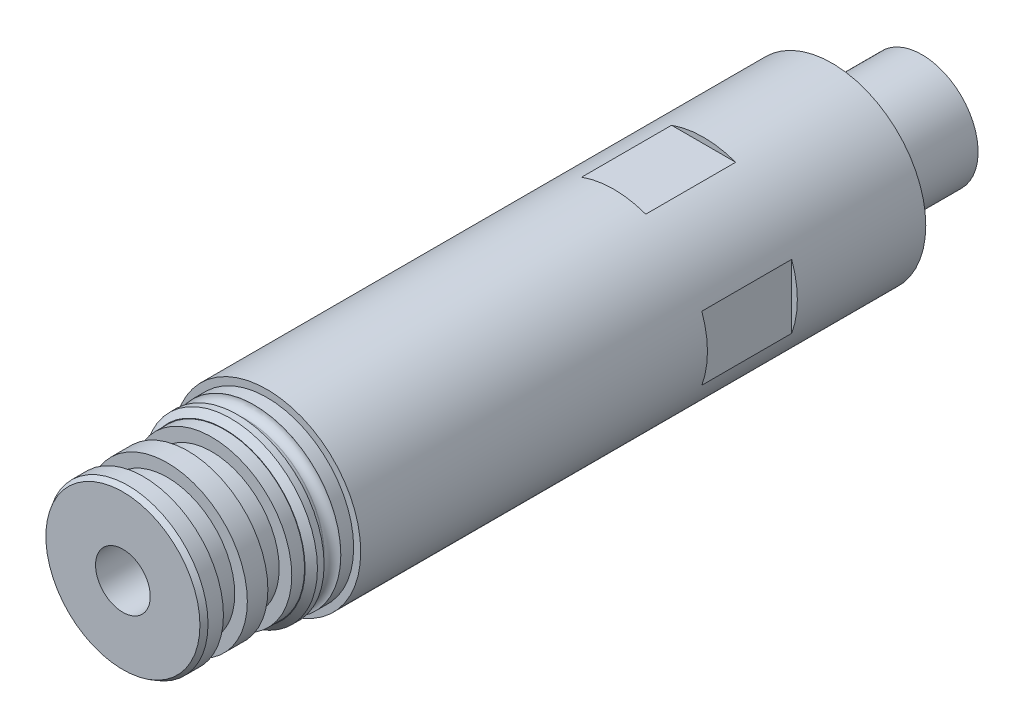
ISO-10303-21;
HEADER;
FILE_DESCRIPTION(('STEP AP214'),'2;1');
FILE_NAME('part.step','',(''),(''),'','','');
FILE_SCHEMA(('AUTOMOTIVE_DESIGN { 1 0 10303 214 1 1 1 1 }'));
ENDSEC;
DATA;
#1=APPLICATION_CONTEXT('core data for automotive mechanical design processes');
#2=APPLICATION_PROTOCOL_DEFINITION('international standard','automotive_design',2000,#1);
#3=PRODUCT_CONTEXT('',#1,'mechanical');
#4=PRODUCT('Part','Part','',(#3));
#5=PRODUCT_RELATED_PRODUCT_CATEGORY('part','',(#4));
#6=PRODUCT_DEFINITION_FORMATION('','',#4);
#7=PRODUCT_DEFINITION_CONTEXT('part definition',#1,'design');
#8=PRODUCT_DEFINITION('design','',#6,#7);
#9=PRODUCT_DEFINITION_SHAPE('','',#8);
#10=(LENGTH_UNIT() NAMED_UNIT(*) SI_UNIT(.MILLI.,.METRE.));
#11=(NAMED_UNIT(*) PLANE_ANGLE_UNIT() SI_UNIT($,.RADIAN.));
#12=(NAMED_UNIT(*) SI_UNIT($,.STERADIAN.) SOLID_ANGLE_UNIT());
#13=UNCERTAINTY_MEASURE_WITH_UNIT(LENGTH_MEASURE(1.E-05),#10,'distance_accuracy_value','');
#14=(GEOMETRIC_REPRESENTATION_CONTEXT(3) GLOBAL_UNCERTAINTY_ASSIGNED_CONTEXT((#13)) GLOBAL_UNIT_ASSIGNED_CONTEXT((#10,
#11,#12)) REPRESENTATION_CONTEXT('',''));
#15=CARTESIAN_POINT('',(0.,0.,0.));
#16=DIRECTION('',(0.,0.,1.));
#17=DIRECTION('',(1.,0.,0.));
#18=AXIS2_PLACEMENT_3D('',#15,#16,#17);
#19=CARTESIAN_POINT('',(0.,0.,65.7352));
#20=DIRECTION('',(0.,0.,-1.));
#21=DIRECTION('',(-1.,0.,0.));
#22=AXIS2_PLACEMENT_3D('',#19,#20,#21);
#23=CYLINDRICAL_SURFACE('',#22,1.5875);
#24=CARTESIAN_POINT('',(0.,0.,-8.89));
#25=DIRECTION('',(0.,0.,-1.));
#26=DIRECTION('',(-1.,0.,0.));
#27=AXIS2_PLACEMENT_3D('',#24,#25,#26);
#28=CIRCLE('',#27,1.5875);
#29=CARTESIAN_POINT('',(-1.5875,0.,-8.89));
#30=VERTEX_POINT('',#29);
#31=EDGE_CURVE('E330',#30,#30,#28,.T.);
#32=ORIENTED_EDGE('',*,*,#31,.T.);
#33=EDGE_LOOP('',(#32));
#34=FACE_BOUND('',#33,.T.);
#35=CARTESIAN_POINT('',(0.,0.,54.8894));
#36=DIRECTION('',(0.,0.,1.));
#37=DIRECTION('',(1.,0.,0.));
#38=AXIS2_PLACEMENT_3D('',#35,#36,#37);
#39=CIRCLE('',#38,1.5875);
#40=CARTESIAN_POINT('',(1.5875,0.,54.8894));
#41=VERTEX_POINT('',#40);
#42=EDGE_CURVE('E306',#41,#41,#39,.F.);
#43=ORIENTED_EDGE('',*,*,#42,.F.);
#44=EDGE_LOOP('',(#43));
#45=FACE_BOUND('',#44,.T.);
#46=ADVANCED_FACE('F31',(#34,#45),#23,.F.);
#47=CARTESIAN_POINT('',(0.,0.,65.7352));
#48=DIRECTION('',(0.,0.,1.));
#49=DIRECTION('',(1.,0.,0.));
#50=AXIS2_PLACEMENT_3D('',#47,#48,#49);
#51=PLANE('',#50);
#52=CARTESIAN_POINT('',(0.,0.,65.7352));
#53=DIRECTION('',(0.,0.,1.));
#54=DIRECTION('',(1.,0.,0.));
#55=AXIS2_PLACEMENT_3D('',#52,#53,#54);
#56=CIRCLE('',#55,7.9121);
#57=CARTESIAN_POINT('',(7.9121,0.,65.7352));
#58=VERTEX_POINT('',#57);
#59=EDGE_CURVE('E335',#58,#58,#56,.T.);
#60=ORIENTED_EDGE('',*,*,#59,.T.);
#61=EDGE_LOOP('',(#60));
#62=FACE_BOUND('',#61,.T.);
#63=CARTESIAN_POINT('',(0.,0.,65.7352));
#64=DIRECTION('',(0.,0.,1.));
#65=DIRECTION('',(1.,0.,0.));
#66=AXIS2_PLACEMENT_3D('',#63,#64,#65);
#67=CIRCLE('',#66,6.6675);
#68=CARTESIAN_POINT('',(6.6675,0.,65.7352));
#69=VERTEX_POINT('',#68);
#70=EDGE_CURVE('E313',#69,#69,#67,.T.);
#71=ORIENTED_EDGE('',*,*,#70,.F.);
#72=EDGE_LOOP('',(#71));
#73=FACE_BOUND('',#72,.T.);
#74=ADVANCED_FACE('F182',(#62,#73),#51,.T.);
#75=CARTESIAN_POINT('',(0.,0.,61.341));
#76=DIRECTION('',(0.,0.,1.));
#77=DIRECTION('',(1.,0.,0.));
#78=AXIS2_PLACEMENT_3D('',#75,#76,#77);
#79=PLANE('',#78);
#80=CARTESIAN_POINT('',(0.,0.,61.341));
#81=DIRECTION('',(0.,0.,1.));
#82=DIRECTION('',(1.,0.,0.));
#83=AXIS2_PLACEMENT_3D('',#80,#81,#82);
#84=CIRCLE('',#83,7.9121);
#85=CARTESIAN_POINT('',(7.9121,0.,61.341));
#86=VERTEX_POINT('',#85);
#87=EDGE_CURVE('E279',#86,#86,#84,.T.);
#88=ORIENTED_EDGE('',*,*,#87,.T.);
#89=EDGE_LOOP('',(#88));
#90=FACE_BOUND('',#89,.T.);
#91=CARTESIAN_POINT('',(0.,0.,61.341));
#92=DIRECTION('',(0.,0.,1.));
#93=DIRECTION('',(1.,0.,0.));
#94=AXIS2_PLACEMENT_3D('',#91,#92,#93);
#95=CIRCLE('',#94,6.6675);
#96=CARTESIAN_POINT('',(6.6675,0.,61.341));
#97=VERTEX_POINT('',#96);
#98=EDGE_CURVE('E338',#97,#97,#95,.T.);
#99=ORIENTED_EDGE('',*,*,#98,.F.);
#100=EDGE_LOOP('',(#99));
#101=FACE_BOUND('',#100,.T.);
#102=ADVANCED_FACE('F188',(#90,#101),#79,.T.);
#103=CARTESIAN_POINT('',(0.,0.,60.071));
#104=DIRECTION('',(0.,0.,1.));
#105=DIRECTION('',(1.,0.,0.));
#106=AXIS2_PLACEMENT_3D('',#103,#104,#105);
#107=PLANE('',#106);
#108=CARTESIAN_POINT('',(0.,0.,60.071));
#109=DIRECTION('',(0.,0.,1.));
#110=DIRECTION('',(1.,0.,0.));
#111=AXIS2_PLACEMENT_3D('',#108,#109,#110);
#112=CIRCLE('',#111,7.9629);
#113=CARTESIAN_POINT('',(7.9629,0.,60.071));
#114=VERTEX_POINT('',#113);
#115=EDGE_CURVE('E155',#114,#114,#112,.T.);
#116=ORIENTED_EDGE('',*,*,#115,.T.);
#117=EDGE_LOOP('',(#116));
#118=FACE_BOUND('',#117,.T.);
#119=CARTESIAN_POINT('',(0.,0.,60.071));
#120=DIRECTION('',(0.,0.,1.));
#121=DIRECTION('',(1.,0.,0.));
#122=AXIS2_PLACEMENT_3D('',#119,#120,#121);
#123=CIRCLE('',#122,7.9121);
#124=CARTESIAN_POINT('',(7.9121,0.,60.071));
#125=VERTEX_POINT('',#124);
#126=EDGE_CURVE('E344',#125,#125,#123,.T.);
#127=ORIENTED_EDGE('',*,*,#126,.F.);
#128=EDGE_LOOP('',(#127));
#129=FACE_BOUND('',#128,.T.);
#130=ADVANCED_FACE('F212',(#118,#129),#107,.T.);
#131=CARTESIAN_POINT('',(0.,0.,57.15));
#132=DIRECTION('',(0.,0.,1.));
#133=DIRECTION('',(1.,0.,0.));
#134=AXIS2_PLACEMENT_3D('',#131,#132,#133);
#135=PLANE('',#134);
#136=CARTESIAN_POINT('',(0.,0.,57.15));
#137=DIRECTION('',(0.,0.,1.));
#138=DIRECTION('',(1.,0.,0.));
#139=AXIS2_PLACEMENT_3D('',#136,#137,#138);
#140=CIRCLE('',#139,8.5598);
#141=CARTESIAN_POINT('',(8.5598,0.,57.15));
#142=VERTEX_POINT('',#141);
#143=EDGE_CURVE('E298',#142,#142,#140,.F.);
#144=ORIENTED_EDGE('',*,*,#143,.T.);
#145=EDGE_LOOP('',(#144));
#146=FACE_BOUND('',#145,.T.);
#147=CARTESIAN_POINT('',(0.,0.,57.15));
#148=DIRECTION('',(0.,0.,1.));
#149=DIRECTION('',(1.,0.,0.));
#150=AXIS2_PLACEMENT_3D('',#147,#148,#149);
#151=CIRCLE('',#150,8.5725);
#152=CARTESIAN_POINT('',(8.5725,0.,57.15));
#153=VERTEX_POINT('',#152);
#154=EDGE_CURVE('E272',#153,#153,#151,.T.);
#155=ORIENTED_EDGE('',*,*,#154,.T.);
#156=EDGE_LOOP('',(#155));
#157=FACE_BOUND('',#156,.T.);
#158=ADVANCED_FACE('F233',(#146,#157),#135,.T.);
#159=CARTESIAN_POINT('',(0.,0.,55.88));
#160=DIRECTION('',(0.,0.,1.));
#161=DIRECTION('',(1.,0.,0.));
#162=AXIS2_PLACEMENT_3D('',#159,#160,#161);
#163=PLANE('',#162);
#164=CARTESIAN_POINT('',(0.,0.,55.88));
#165=DIRECTION('',(0.,0.,1.));
#166=DIRECTION('',(1.,0.,0.));
#167=AXIS2_PLACEMENT_3D('',#164,#165,#166);
#168=CIRCLE('',#167,9.271);
#169=CARTESIAN_POINT('',(9.271,0.,55.88));
#170=VERTEX_POINT('',#169);
#171=EDGE_CURVE('E267',#170,#170,#168,.T.);
#172=ORIENTED_EDGE('',*,*,#171,.T.);
#173=EDGE_LOOP('',(#172));
#174=FACE_BOUND('',#173,.T.);
#175=CARTESIAN_POINT('',(0.,0.,55.88));
#176=DIRECTION('',(0.,0.,1.));
#177=DIRECTION('',(1.,0.,0.));
#178=AXIS2_PLACEMENT_3D('',#175,#176,#177);
#179=CIRCLE('',#178,8.5725);
#180=CARTESIAN_POINT('',(8.5725,0.,55.88));
#181=VERTEX_POINT('',#180);
#182=EDGE_CURVE('E270',#181,#181,#179,.T.);
#183=ORIENTED_EDGE('',*,*,#182,.F.);
#184=EDGE_LOOP('',(#183));
#185=FACE_BOUND('',#184,.T.);
#186=ADVANCED_FACE('F244',(#174,#185),#163,.T.);
#187=CARTESIAN_POINT('',(0.,0.,0.));
#188=DIRECTION('',(0.,0.,1.));
#189=DIRECTION('',(1.,0.,0.));
#190=AXIS2_PLACEMENT_3D('',#187,#188,#189);
#191=PLANE('',#190);
#192=CARTESIAN_POINT('',(0.,0.,0.));
#193=DIRECTION('',(0.,0.,1.));
#194=DIRECTION('',(1.,0.,0.));
#195=AXIS2_PLACEMENT_3D('',#192,#193,#194);
#196=CIRCLE('',#195,5.4102);
#197=CARTESIAN_POINT('',(5.4102,0.,0.));
#198=VERTEX_POINT('',#197);
#199=EDGE_CURVE('E11',#198,#198,#196,.T.);
#200=ORIENTED_EDGE('',*,*,#199,.T.);
#201=EDGE_LOOP('',(#200));
#202=FACE_BOUND('',#201,.T.);
#203=CARTESIAN_POINT('',(0.,0.,0.));
#204=DIRECTION('',(0.,0.,1.));
#205=DIRECTION('',(1.,0.,0.));
#206=AXIS2_PLACEMENT_3D('',#203,#204,#205);
#207=CIRCLE('',#206,9.271);
#208=CARTESIAN_POINT('',(9.271,0.,0.));
#209=VERTEX_POINT('',#208);
#210=EDGE_CURVE('E285',#209,#209,#207,.T.);
#211=ORIENTED_EDGE('',*,*,#210,.F.);
#212=EDGE_LOOP('',(#211));
#213=FACE_BOUND('',#212,.T.);
#214=ADVANCED_FACE('F257',(#202,#213),#191,.F.);
#215=CARTESIAN_POINT('',(0.,0.,55.88));
#216=DIRECTION('',(0.,0.,-1.));
#217=DIRECTION('',(-1.,0.,0.));
#218=AXIS2_PLACEMENT_3D('',#215,#216,#217);
#219=CYLINDRICAL_SURFACE('',#218,9.271);
#220=CARTESIAN_POINT('',(0.,0.,21.59));
#221=DIRECTION('',(0.,0.,1.));
#222=DIRECTION('',(1.,0.,0.));
#223=AXIS2_PLACEMENT_3D('',#220,#221,#222);
#224=CIRCLE('',#223,9.271);
#225=CARTESIAN_POINT('',(-8.7122,3.17001769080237,21.59));
#226=VERTEX_POINT('',#225);
#227=CARTESIAN_POINT('',(-8.7122,-3.17001769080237,21.59));
#228=VERTEX_POINT('',#227);
#229=EDGE_CURVE('E121',#226,#228,#224,.T.);
#230=ORIENTED_EDGE('',*,*,#229,.T.);
#231=DIRECTION('',(0.,0.,-1.));
#232=VECTOR('',#231,1.);
#233=CARTESIAN_POINT('',(-8.7122,-3.17001769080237,55.88));
#234=LINE('',#233,#232);
#235=CARTESIAN_POINT('',(-8.7122,-3.17001769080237,12.7));
#236=VERTEX_POINT('',#235);
#237=EDGE_CURVE('E152',#228,#236,#234,.T.);
#238=ORIENTED_EDGE('',*,*,#237,.T.);
#239=CARTESIAN_POINT('',(0.,0.,12.7));
#240=DIRECTION('',(0.,0.,1.));
#241=DIRECTION('',(1.,0.,0.));
#242=AXIS2_PLACEMENT_3D('',#239,#240,#241);
#243=CIRCLE('',#242,9.271);
#244=CARTESIAN_POINT('',(-8.7122,3.17001769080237,12.7));
#245=VERTEX_POINT('',#244);
#246=EDGE_CURVE('E118',#245,#236,#243,.T.);
#247=ORIENTED_EDGE('',*,*,#246,.F.);
#248=DIRECTION('',(0.,0.,-1.));
#249=VECTOR('',#248,1.);
#250=CARTESIAN_POINT('',(-8.7122,3.17001769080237,55.88));
#251=LINE('',#250,#249);
#252=EDGE_CURVE('E123',#245,#226,#251,.F.);
#253=ORIENTED_EDGE('',*,*,#252,.T.);
#254=EDGE_LOOP('',(#230,#238,#247,#253));
#255=FACE_BOUND('',#254,.T.);
#256=CARTESIAN_POINT('',(-3.17001769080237,-8.7122,21.59));
#257=VERTEX_POINT('',#256);
#258=CARTESIAN_POINT('',(3.17001769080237,-8.7122,21.59));
#259=VERTEX_POINT('',#258);
#260=EDGE_CURVE('E132',#257,#259,#224,.T.);
#261=ORIENTED_EDGE('',*,*,#260,.T.);
#262=DIRECTION('',(0.,0.,-1.));
#263=VECTOR('',#262,1.);
#264=CARTESIAN_POINT('',(3.17001769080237,-8.7122,55.88));
#265=LINE('',#264,#263);
#266=CARTESIAN_POINT('',(3.17001769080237,-8.7122,12.7));
#267=VERTEX_POINT('',#266);
#268=EDGE_CURVE('E141',#259,#267,#265,.T.);
#269=ORIENTED_EDGE('',*,*,#268,.T.);
#270=CARTESIAN_POINT('',(-3.17001769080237,-8.7122,12.7));
#271=VERTEX_POINT('',#270);
#272=EDGE_CURVE('E124',#271,#267,#243,.T.);
#273=ORIENTED_EDGE('',*,*,#272,.F.);
#274=DIRECTION('',(0.,0.,-1.));
#275=VECTOR('',#274,1.);
#276=CARTESIAN_POINT('',(-3.17001769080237,-8.7122,55.88));
#277=LINE('',#276,#275);
#278=EDGE_CURVE('E135',#271,#257,#277,.F.);
#279=ORIENTED_EDGE('',*,*,#278,.T.);
#280=EDGE_LOOP('',(#261,#269,#273,#279));
#281=FACE_BOUND('',#280,.T.);
#282=CARTESIAN_POINT('',(8.7122,-3.17001769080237,21.59));
#283=VERTEX_POINT('',#282);
#284=CARTESIAN_POINT('',(8.7122,3.17001769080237,21.59));
#285=VERTEX_POINT('',#284);
#286=EDGE_CURVE('E122',#283,#285,#224,.T.);
#287=ORIENTED_EDGE('',*,*,#286,.T.);
#288=DIRECTION('',(0.,0.,-1.));
#289=VECTOR('',#288,1.);
#290=CARTESIAN_POINT('',(8.7122,3.17001769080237,55.88));
#291=LINE('',#290,#289);
#292=CARTESIAN_POINT('',(8.7122,3.17001769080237,12.7));
#293=VERTEX_POINT('',#292);
#294=EDGE_CURVE('E131',#285,#293,#291,.T.);
#295=ORIENTED_EDGE('',*,*,#294,.T.);
#296=CARTESIAN_POINT('',(8.7122,-3.17001769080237,12.7));
#297=VERTEX_POINT('',#296);
#298=EDGE_CURVE('E119',#297,#293,#243,.T.);
#299=ORIENTED_EDGE('',*,*,#298,.F.);
#300=DIRECTION('',(0.,0.,-1.));
#301=VECTOR('',#300,1.);
#302=CARTESIAN_POINT('',(8.7122,-3.17001769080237,55.88));
#303=LINE('',#302,#301);
#304=EDGE_CURVE('E125',#297,#283,#303,.F.);
#305=ORIENTED_EDGE('',*,*,#304,.T.);
#306=EDGE_LOOP('',(#287,#295,#299,#305));
#307=FACE_BOUND('',#306,.T.);
#308=CARTESIAN_POINT('',(3.17001769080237,8.7122,21.59));
#309=VERTEX_POINT('',#308);
#310=CARTESIAN_POINT('',(-3.17001769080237,8.7122,21.59));
#311=VERTEX_POINT('',#310);
#312=EDGE_CURVE('E116',#309,#311,#224,.T.);
#313=ORIENTED_EDGE('',*,*,#312,.T.);
#314=DIRECTION('',(0.,0.,-1.));
#315=VECTOR('',#314,1.);
#316=CARTESIAN_POINT('',(-3.17001769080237,8.7122,55.88));
#317=LINE('',#316,#315);
#318=CARTESIAN_POINT('',(-3.17001769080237,8.7122,12.7));
#319=VERTEX_POINT('',#318);
#320=EDGE_CURVE('E115',#311,#319,#317,.T.);
#321=ORIENTED_EDGE('',*,*,#320,.T.);
#322=CARTESIAN_POINT('',(3.17001769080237,8.7122,12.7));
#323=VERTEX_POINT('',#322);
#324=EDGE_CURVE('E107',#323,#319,#243,.T.);
#325=ORIENTED_EDGE('',*,*,#324,.F.);
#326=DIRECTION('',(0.,0.,-1.));
#327=VECTOR('',#326,1.);
#328=CARTESIAN_POINT('',(3.17001769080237,8.7122,55.88));
#329=LINE('',#328,#327);
#330=EDGE_CURVE('E96',#323,#309,#329,.F.);
#331=ORIENTED_EDGE('',*,*,#330,.T.);
#332=EDGE_LOOP('',(#313,#321,#325,#331));
#333=FACE_BOUND('',#332,.T.);
#334=ORIENTED_EDGE('',*,*,#171,.F.);
#335=EDGE_LOOP('',(#334));
#336=FACE_BOUND('',#335,.T.);
#337=ORIENTED_EDGE('',*,*,#210,.T.);
#338=EDGE_LOOP('',(#337));
#339=FACE_BOUND('',#338,.T.);
#340=ADVANCED_FACE('F33',(#255,#281,#307,#333,#336,#339),#219,.T.);
#341=CARTESIAN_POINT('',(0.,0.,-8.89));
#342=DIRECTION('',(0.,0.,1.));
#343=DIRECTION('',(1.,0.,0.));
#344=AXIS2_PLACEMENT_3D('',#341,#342,#343);
#345=CYLINDRICAL_SURFACE('',#344,5.55625);
#346=CARTESIAN_POINT('',(0.,0.,-1.905));
#347=DIRECTION('',(0.,0.,-1.));
#348=DIRECTION('',(-1.,0.,0.));
#349=AXIS2_PLACEMENT_3D('',#346,#347,#348);
#350=CIRCLE('',#349,5.55625);
#351=CARTESIAN_POINT('',(-5.55625,0.,-1.905));
#352=VERTEX_POINT('',#351);
#353=EDGE_CURVE('E161',#352,#352,#350,.T.);
#354=ORIENTED_EDGE('',*,*,#353,.T.);
#355=EDGE_LOOP('',(#354));
#356=FACE_BOUND('',#355,.T.);
#357=CARTESIAN_POINT('',(0.,0.,-8.89));
#358=DIRECTION('',(0.,0.,-1.));
#359=DIRECTION('',(-1.,0.,0.));
#360=AXIS2_PLACEMENT_3D('',#357,#358,#359);
#361=CIRCLE('',#360,5.55625);
#362=CARTESIAN_POINT('',(-5.55625,0.,-8.89));
#363=VERTEX_POINT('',#362);
#364=EDGE_CURVE('E276',#363,#363,#361,.T.);
#365=ORIENTED_EDGE('',*,*,#364,.F.);
#366=EDGE_LOOP('',(#365));
#367=FACE_BOUND('',#366,.T.);
#368=ADVANCED_FACE('F252',(#356,#367),#345,.T.);
#369=CARTESIAN_POINT('',(0.,0.,-8.89));
#370=DIRECTION('',(0.,0.,-1.));
#371=DIRECTION('',(-1.,0.,0.));
#372=AXIS2_PLACEMENT_3D('',#369,#370,#371);
#373=PLANE('',#372);
#374=ORIENTED_EDGE('',*,*,#31,.F.);
#375=EDGE_LOOP('',(#374));
#376=FACE_BOUND('',#375,.T.);
#377=ORIENTED_EDGE('',*,*,#364,.T.);
#378=EDGE_LOOP('',(#377));
#379=FACE_BOUND('',#378,.T.);
#380=ADVANCED_FACE('F248',(#376,#379),#373,.T.);
#381=CARTESIAN_POINT('',(0.,0.,57.15));
#382=DIRECTION('',(0.,0.,-1.));
#383=DIRECTION('',(-1.,0.,0.));
#384=AXIS2_PLACEMENT_3D('',#381,#382,#383);
#385=CYLINDRICAL_SURFACE('',#384,8.5725);
#386=ORIENTED_EDGE('',*,*,#154,.F.);
#387=EDGE_LOOP('',(#386));
#388=FACE_BOUND('',#387,.T.);
#389=ORIENTED_EDGE('',*,*,#182,.T.);
#390=EDGE_LOOP('',(#389));
#391=FACE_BOUND('',#390,.T.);
#392=ADVANCED_FACE('F240',(#388,#391),#385,.T.);
#393=CARTESIAN_POINT('',(0.,0.,58.801));
#394=DIRECTION('',(0.,0.,-1.));
#395=DIRECTION('',(-1.,0.,0.));
#396=AXIS2_PLACEMENT_3D('',#393,#394,#395);
#397=CYLINDRICAL_SURFACE('',#396,7.747);
#398=CARTESIAN_POINT('',(0.,0.,57.9882));
#399=DIRECTION('',(0.,0.,1.));
#400=DIRECTION('',(1.,0.,0.));
#401=AXIS2_PLACEMENT_3D('',#398,#399,#400);
#402=CIRCLE('',#401,7.747);
#403=CARTESIAN_POINT('',(-7.747,0.,57.9882));
#404=VERTEX_POINT('',#403);
#405=EDGE_CURVE('E295',#404,#404,#402,.F.);
#406=CARTESIAN_POINT('',(0.,0.,57.9628));
#407=DIRECTION('',(0.,0.,1.));
#408=DIRECTION('',(1.,0.,0.));
#409=AXIS2_PLACEMENT_3D('',#406,#407,#408);
#410=CIRCLE('',#409,7.747);
#411=CARTESIAN_POINT('',(-7.747,0.,57.9628));
#412=VERTEX_POINT('',#411);
#413=EDGE_CURVE('E292',#412,#412,#410,.T.);
#414=CARTESIAN_POINT('',(-7.747,0.,57.9882));
#415=CARTESIAN_POINT('',(-7.747,0.,57.9879354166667));
#416=CARTESIAN_POINT('',(-7.747,0.,57.9876708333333));
#417=CARTESIAN_POINT('',(-7.747,0.,57.9871416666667));
#418=CARTESIAN_POINT('',(-7.747,0.,57.9868770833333));
#419=CARTESIAN_POINT('',(-7.747,0.,57.9863479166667));
#420=CARTESIAN_POINT('',(-7.747,0.,57.9860833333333));
#421=CARTESIAN_POINT('',(-7.747,0.,57.9855541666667));
#422=CARTESIAN_POINT('',(-7.747,0.,57.9852895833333));
#423=CARTESIAN_POINT('',(-7.747,0.,57.9847604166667));
#424=CARTESIAN_POINT('',(-7.747,0.,57.9844958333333));
#425=CARTESIAN_POINT('',(-7.747,0.,57.9839666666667));
#426=CARTESIAN_POINT('',(-7.747,0.,57.9837020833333));
#427=CARTESIAN_POINT('',(-7.747,0.,57.9831729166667));
#428=CARTESIAN_POINT('',(-7.747,0.,57.9829083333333));
#429=CARTESIAN_POINT('',(-7.747,0.,57.9823791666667));
#430=CARTESIAN_POINT('',(-7.747,0.,57.9821145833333));
#431=CARTESIAN_POINT('',(-7.747,0.,57.9815854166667));
#432=CARTESIAN_POINT('',(-7.747,0.,57.9813208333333));
#433=CARTESIAN_POINT('',(-7.747,0.,57.9807916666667));
#434=CARTESIAN_POINT('',(-7.747,0.,57.9805270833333));
#435=CARTESIAN_POINT('',(-7.747,0.,57.9799979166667));
#436=CARTESIAN_POINT('',(-7.747,0.,57.9797333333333));
#437=CARTESIAN_POINT('',(-7.747,0.,57.9792041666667));
#438=CARTESIAN_POINT('',(-7.747,0.,57.9789395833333));
#439=CARTESIAN_POINT('',(-7.747,0.,57.9784104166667));
#440=CARTESIAN_POINT('',(-7.747,0.,57.9781458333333));
#441=CARTESIAN_POINT('',(-7.747,0.,57.9776166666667));
#442=CARTESIAN_POINT('',(-7.747,0.,57.9773520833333));
#443=CARTESIAN_POINT('',(-7.747,0.,57.9768229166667));
#444=CARTESIAN_POINT('',(-7.747,0.,57.9765583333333));
#445=CARTESIAN_POINT('',(-7.747,0.,57.9760291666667));
#446=CARTESIAN_POINT('',(-7.747,0.,57.9757645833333));
#447=CARTESIAN_POINT('',(-7.747,0.,57.9752354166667));
#448=CARTESIAN_POINT('',(-7.747,0.,57.9749708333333));
#449=CARTESIAN_POINT('',(-7.747,0.,57.9744416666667));
#450=CARTESIAN_POINT('',(-7.747,0.,57.9741770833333));
#451=CARTESIAN_POINT('',(-7.747,0.,57.9736479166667));
#452=CARTESIAN_POINT('',(-7.747,0.,57.9733833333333));
#453=CARTESIAN_POINT('',(-7.747,0.,57.9728541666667));
#454=CARTESIAN_POINT('',(-7.747,0.,57.9725895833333));
#455=CARTESIAN_POINT('',(-7.747,0.,57.9720604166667));
#456=CARTESIAN_POINT('',(-7.747,0.,57.9717958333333));
#457=CARTESIAN_POINT('',(-7.747,0.,57.9712666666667));
#458=CARTESIAN_POINT('',(-7.747,0.,57.9710020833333));
#459=CARTESIAN_POINT('',(-7.747,0.,57.9704729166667));
#460=CARTESIAN_POINT('',(-7.747,0.,57.9702083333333));
#461=CARTESIAN_POINT('',(-7.747,0.,57.9696791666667));
#462=CARTESIAN_POINT('',(-7.747,0.,57.9694145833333));
#463=CARTESIAN_POINT('',(-7.747,0.,57.9688854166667));
#464=CARTESIAN_POINT('',(-7.747,0.,57.9686208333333));
#465=CARTESIAN_POINT('',(-7.747,0.,57.9680916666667));
#466=CARTESIAN_POINT('',(-7.747,0.,57.9678270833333));
#467=CARTESIAN_POINT('',(-7.747,0.,57.9672979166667));
#468=CARTESIAN_POINT('',(-7.747,0.,57.9670333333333));
#469=CARTESIAN_POINT('',(-7.747,0.,57.9665041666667));
#470=CARTESIAN_POINT('',(-7.747,0.,57.9662395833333));
#471=CARTESIAN_POINT('',(-7.747,0.,57.9657104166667));
#472=CARTESIAN_POINT('',(-7.747,0.,57.9654458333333));
#473=CARTESIAN_POINT('',(-7.747,0.,57.9649166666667));
#474=CARTESIAN_POINT('',(-7.747,0.,57.9646520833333));
#475=CARTESIAN_POINT('',(-7.747,0.,57.9641229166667));
#476=CARTESIAN_POINT('',(-7.747,0.,57.9638583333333));
#477=CARTESIAN_POINT('',(-7.747,0.,57.9633291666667));
#478=CARTESIAN_POINT('',(-7.747,0.,57.9630645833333));
#479=CARTESIAN_POINT('',(-7.747,0.,57.9628));
#480=B_SPLINE_CURVE_WITH_KNOTS('',3,(#414,#415,#416,#417,#418,#419,#420,#421,#422,#423,#424,
#425,#426,#427,#428,#429,#430,#431,#432,#433,#434,#435,#436,#437,#438,#439,#440,#441,#442,#443,
#444,#445,#446,#447,#448,#449,#450,#451,#452,#453,#454,#455,#456,#457,#458,#459,#460,#461,#462,
#463,#464,#465,#466,#467,#468,#469,#470,#471,#472,#473,#474,#475,#476,#477,#478,#479),
.UNSPECIFIED.,.F.,.F.,(4,2,2,2,2,2,2,2,2,2,2,2,2,2,2,2,2,2,2,2,2,2,2,2,2,2,2,2,2,2,2,2,4),(0.,
0.000793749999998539,0.00158749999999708,0.00238124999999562,0.00317499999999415,
0.00396874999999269,0.00476249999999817,0.00555624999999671,0.00634999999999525,
0.00714374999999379,0.00793749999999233,0.0087312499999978,0.00952499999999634,
0.0103187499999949,0.0111124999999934,0.011906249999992,0.0126999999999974,0.013493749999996,
0.0142874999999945,0.0150812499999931,0.0158749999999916,0.0166687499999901,0.0174624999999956,
0.0182562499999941,0.0190499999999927,0.0198437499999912,0.0206374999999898,0.0214312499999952,
0.0222249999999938,0.0230187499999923,0.0238124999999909,0.0246062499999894,0.0253999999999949),.UNSPECIFIED.);
#481=EDGE_CURVE('BSEAM229',#404,#412,#480,.T.);
#482=ORIENTED_EDGE('',*,*,#405,.T.);
#483=ORIENTED_EDGE('',*,*,#413,.T.);
#484=ORIENTED_EDGE('',*,*,#481,.T.);
#485=ORIENTED_EDGE('',*,*,#481,.F.);
#486=EDGE_LOOP('',(#482,#484,#483,#485));
#487=FACE_BOUND('',#486,.T.);
#488=ADVANCED_FACE('F229',(#487),#397,.T.);
#489=CARTESIAN_POINT('',(0.,0.,58.801));
#490=DIRECTION('',(0.,0.,1.));
#491=DIRECTION('',(1.,0.,0.));
#492=AXIS2_PLACEMENT_3D('',#489,#490,#491);
#493=PLANE('',#492);
#494=CARTESIAN_POINT('',(0.,0.,58.801));
#495=DIRECTION('',(0.,0.,1.));
#496=DIRECTION('',(1.,0.,0.));
#497=AXIS2_PLACEMENT_3D('',#494,#495,#496);
#498=CIRCLE('',#497,8.5598);
#499=CARTESIAN_POINT('',(8.5598,0.,58.801));
#500=VERTEX_POINT('',#499);
#501=EDGE_CURVE('E289',#500,#500,#498,.T.);
#502=ORIENTED_EDGE('',*,*,#501,.T.);
#503=EDGE_LOOP('',(#502));
#504=FACE_BOUND('',#503,.T.);
#505=CARTESIAN_POINT('',(0.,0.,58.801));
#506=DIRECTION('',(0.,0.,1.));
#507=DIRECTION('',(1.,0.,0.));
#508=AXIS2_PLACEMENT_3D('',#505,#506,#507);
#509=CIRCLE('',#508,8.5725);
#510=CARTESIAN_POINT('',(8.5725,0.,58.801));
#511=VERTEX_POINT('',#510);
#512=EDGE_CURVE('E273',#511,#511,#509,.T.);
#513=ORIENTED_EDGE('',*,*,#512,.F.);
#514=EDGE_LOOP('',(#513));
#515=FACE_BOUND('',#514,.T.);
#516=ADVANCED_FACE('F226',(#504,#515),#493,.F.);
#517=CARTESIAN_POINT('',(0.,0.,60.071));
#518=DIRECTION('',(0.,0.,-1.));
#519=DIRECTION('',(-1.,0.,0.));
#520=AXIS2_PLACEMENT_3D('',#517,#518,#519);
#521=CYLINDRICAL_SURFACE('',#520,8.5725);
#522=CARTESIAN_POINT('',(0.,0.,59.4614));
#523=DIRECTION('',(0.,0.,1.));
#524=DIRECTION('',(1.,0.,0.));
#525=AXIS2_PLACEMENT_3D('',#522,#523,#524);
#526=CIRCLE('',#525,8.5725);
#527=CARTESIAN_POINT('',(8.5725,0.,59.4614));
#528=VERTEX_POINT('',#527);
#529=EDGE_CURVE('E158',#528,#528,#526,.F.);
#530=ORIENTED_EDGE('',*,*,#529,.T.);
#531=EDGE_LOOP('',(#530));
#532=FACE_BOUND('',#531,.T.);
#533=ORIENTED_EDGE('',*,*,#512,.T.);
#534=EDGE_LOOP('',(#533));
#535=FACE_BOUND('',#534,.T.);
#536=ADVANCED_FACE('F224',(#532,#535),#521,.T.);
#537=CARTESIAN_POINT('',(0.,0.,57.9882));
#538=DIRECTION('',(0.,0.,1.));
#539=DIRECTION('',(1.,0.,0.));
#540=AXIS2_PLACEMENT_3D('',#537,#538,#539);
#541=TOROIDAL_SURFACE('',#540,8.5598,0.8128);
#542=ORIENTED_EDGE('',*,*,#405,.F.);
#543=EDGE_LOOP('',(#542));
#544=FACE_BOUND('',#543,.T.);
#545=ORIENTED_EDGE('',*,*,#501,.F.);
#546=EDGE_LOOP('',(#545));
#547=FACE_BOUND('',#546,.T.);
#548=ADVANCED_FACE('F220',(#544,#547),#541,.F.);
#549=CARTESIAN_POINT('',(0.,0.,57.9628));
#550=DIRECTION('',(0.,0.,1.));
#551=DIRECTION('',(1.,0.,0.));
#552=AXIS2_PLACEMENT_3D('',#549,#550,#551);
#553=TOROIDAL_SURFACE('',#552,8.5598,0.8128);
#554=ORIENTED_EDGE('',*,*,#143,.F.);
#555=EDGE_LOOP('',(#554));
#556=FACE_BOUND('',#555,.T.);
#557=ORIENTED_EDGE('',*,*,#413,.F.);
#558=EDGE_LOOP('',(#557));
#559=FACE_BOUND('',#558,.T.);
#560=ADVANCED_FACE('F216',(#556,#559),#553,.F.);
#561=CARTESIAN_POINT('',(0.,0.,61.341));
#562=DIRECTION('',(0.,0.,-1.));
#563=DIRECTION('',(-1.,0.,0.));
#564=AXIS2_PLACEMENT_3D('',#561,#562,#563);
#565=CYLINDRICAL_SURFACE('',#564,7.9121);
#566=ORIENTED_EDGE('',*,*,#87,.F.);
#567=EDGE_LOOP('',(#566));
#568=FACE_BOUND('',#567,.T.);
#569=ORIENTED_EDGE('',*,*,#126,.T.);
#570=EDGE_LOOP('',(#569));
#571=FACE_BOUND('',#570,.T.);
#572=ADVANCED_FACE('F208',(#568,#571),#565,.T.);
#573=CARTESIAN_POINT('',(0.,0.,63.7032));
#574=DIRECTION('',(0.,0.,-1.));
#575=DIRECTION('',(-1.,0.,0.));
#576=AXIS2_PLACEMENT_3D('',#573,#574,#575);
#577=CYLINDRICAL_SURFACE('',#576,6.6675);
#578=CARTESIAN_POINT('',(0.,0.,63.7032));
#579=DIRECTION('',(0.,0.,1.));
#580=DIRECTION('',(1.,0.,0.));
#581=AXIS2_PLACEMENT_3D('',#578,#579,#580);
#582=CIRCLE('',#581,6.6675);
#583=CARTESIAN_POINT('',(6.6675,0.,63.7032));
#584=VERTEX_POINT('',#583);
#585=EDGE_CURVE('E341',#584,#584,#582,.T.);
#586=ORIENTED_EDGE('',*,*,#585,.F.);
#587=EDGE_LOOP('',(#586));
#588=FACE_BOUND('',#587,.T.);
#589=ORIENTED_EDGE('',*,*,#98,.T.);
#590=EDGE_LOOP('',(#589));
#591=FACE_BOUND('',#590,.T.);
#592=ADVANCED_FACE('F200',(#588,#591),#577,.T.);
#593=CARTESIAN_POINT('',(0.,0.,63.7032));
#594=DIRECTION('',(0.,0.,1.));
#595=DIRECTION('',(1.,0.,0.));
#596=AXIS2_PLACEMENT_3D('',#593,#594,#595);
#597=PLANE('',#596);
#598=CARTESIAN_POINT('',(0.,0.,63.7032));
#599=DIRECTION('',(0.,0.,1.));
#600=DIRECTION('',(1.,0.,0.));
#601=AXIS2_PLACEMENT_3D('',#598,#599,#600);
#602=CIRCLE('',#601,7.9121);
#603=CARTESIAN_POINT('',(7.9121,0.,63.7032));
#604=VERTEX_POINT('',#603);
#605=EDGE_CURVE('E332',#604,#604,#602,.T.);
#606=ORIENTED_EDGE('',*,*,#605,.F.);
#607=EDGE_LOOP('',(#606));
#608=FACE_BOUND('',#607,.T.);
#609=ORIENTED_EDGE('',*,*,#585,.T.);
#610=EDGE_LOOP('',(#609));
#611=FACE_BOUND('',#610,.T.);
#612=ADVANCED_FACE('F197',(#608,#611),#597,.F.);
#613=CARTESIAN_POINT('',(0.,0.,65.7352));
#614=DIRECTION('',(0.,0.,-1.));
#615=DIRECTION('',(-1.,0.,0.));
#616=AXIS2_PLACEMENT_3D('',#613,#614,#615);
#617=CYLINDRICAL_SURFACE('',#616,7.9121);
#618=ORIENTED_EDGE('',*,*,#59,.F.);
#619=EDGE_LOOP('',(#618));
#620=FACE_BOUND('',#619,.T.);
#621=ORIENTED_EDGE('',*,*,#605,.T.);
#622=EDGE_LOOP('',(#621));
#623=FACE_BOUND('',#622,.T.);
#624=ADVANCED_FACE('F199',(#620,#623),#617,.T.);
#625=CARTESIAN_POINT('',(0.,0.,68.0974));
#626=DIRECTION('',(0.,0.,-1.));
#627=DIRECTION('',(-1.,0.,0.));
#628=AXIS2_PLACEMENT_3D('',#625,#626,#627);
#629=CYLINDRICAL_SURFACE('',#628,6.6675);
#630=CARTESIAN_POINT('',(0.,0.,68.0974));
#631=DIRECTION('',(0.,0.,1.));
#632=DIRECTION('',(1.,0.,0.));
#633=AXIS2_PLACEMENT_3D('',#630,#631,#632);
#634=CIRCLE('',#633,6.6675);
#635=CARTESIAN_POINT('',(6.6675,0.,68.0974));
#636=VERTEX_POINT('',#635);
#637=EDGE_CURVE('E327',#636,#636,#634,.T.);
#638=ORIENTED_EDGE('',*,*,#637,.F.);
#639=EDGE_LOOP('',(#638));
#640=FACE_BOUND('',#639,.T.);
#641=ORIENTED_EDGE('',*,*,#70,.T.);
#642=EDGE_LOOP('',(#641));
#643=FACE_BOUND('',#642,.T.);
#644=ADVANCED_FACE('F195',(#640,#643),#629,.T.);
#645=CARTESIAN_POINT('',(0.,0.,68.0974));
#646=DIRECTION('',(0.,0.,1.));
#647=DIRECTION('',(1.,0.,0.));
#648=AXIS2_PLACEMENT_3D('',#645,#646,#647);
#649=PLANE('',#648);
#650=CARTESIAN_POINT('',(0.,0.,68.0974));
#651=DIRECTION('',(0.,0.,1.));
#652=DIRECTION('',(1.,0.,0.));
#653=AXIS2_PLACEMENT_3D('',#650,#651,#652);
#654=CIRCLE('',#653,7.9121);
#655=CARTESIAN_POINT('',(7.9121,0.,68.0974));
#656=VERTEX_POINT('',#655);
#657=EDGE_CURVE('E308',#656,#656,#654,.T.);
#658=ORIENTED_EDGE('',*,*,#657,.F.);
#659=EDGE_LOOP('',(#658));
#660=FACE_BOUND('',#659,.T.);
#661=ORIENTED_EDGE('',*,*,#637,.T.);
#662=EDGE_LOOP('',(#661));
#663=FACE_BOUND('',#662,.T.);
#664=ADVANCED_FACE('F363',(#660,#663),#649,.F.);
#665=CARTESIAN_POINT('',(0.,0.,70.1294));
#666=DIRECTION('',(0.,0.,-1.));
#667=DIRECTION('',(-1.,0.,0.));
#668=AXIS2_PLACEMENT_3D('',#665,#666,#667);
#669=CYLINDRICAL_SURFACE('',#668,7.9121);
#670=CARTESIAN_POINT('',(0.,0.,69.6214));
#671=DIRECTION('',(0.,0.,1.));
#672=DIRECTION('',(1.,0.,0.));
#673=AXIS2_PLACEMENT_3D('',#670,#671,#672);
#674=CIRCLE('',#673,7.9121);
#675=CARTESIAN_POINT('',(7.9121,0.,69.6214));
#676=VERTEX_POINT('',#675);
#677=EDGE_CURVE('E108',#676,#676,#674,.F.);
#678=ORIENTED_EDGE('',*,*,#677,.T.);
#679=EDGE_LOOP('',(#678));
#680=FACE_BOUND('',#679,.T.);
#681=ORIENTED_EDGE('',*,*,#657,.T.);
#682=EDGE_LOOP('',(#681));
#683=FACE_BOUND('',#682,.T.);
#684=ADVANCED_FACE('F368',(#680,#683),#669,.T.);
#685=CARTESIAN_POINT('',(0.,0.,70.1294));
#686=DIRECTION('',(0.,0.,1.));
#687=DIRECTION('',(1.,0.,0.));
#688=AXIS2_PLACEMENT_3D('',#685,#686,#687);
#689=PLANE('',#688);
#690=CARTESIAN_POINT('',(0.,0.,70.1294));
#691=DIRECTION('',(0.,0.,1.));
#692=DIRECTION('',(1.,0.,0.));
#693=AXIS2_PLACEMENT_3D('',#690,#691,#692);
#694=CIRCLE('',#693,2.7051);
#695=CARTESIAN_POINT('',(2.7051,0.,70.1294));
#696=VERTEX_POINT('',#695);
#697=EDGE_CURVE('E316',#696,#696,#694,.T.);
#698=ORIENTED_EDGE('',*,*,#697,.F.);
#699=EDGE_LOOP('',(#698));
#700=FACE_BOUND('',#699,.T.);
#701=CARTESIAN_POINT('',(0.,0.,70.1294));
#702=DIRECTION('',(0.,0.,1.));
#703=DIRECTION('',(1.,0.,0.));
#704=AXIS2_PLACEMENT_3D('',#701,#702,#703);
#705=CIRCLE('',#704,7.61880606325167);
#706=CARTESIAN_POINT('',(7.61880606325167,0.,70.1294));
#707=VERTEX_POINT('',#706);
#708=EDGE_CURVE('E301',#707,#707,#705,.T.);
#709=ORIENTED_EDGE('',*,*,#708,.T.);
#710=EDGE_LOOP('',(#709));
#711=FACE_BOUND('',#710,.T.);
#712=ADVANCED_FACE('F376',(#700,#711),#689,.T.);
#713=CARTESIAN_POINT('',(0.,0.,70.1294));
#714=DIRECTION('',(0.,0.,-1.));
#715=DIRECTION('',(-1.,0.,0.));
#716=AXIS2_PLACEMENT_3D('',#713,#714,#715);
#717=CONICAL_SURFACE('',#716,7.61880606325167,0.52359877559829);
#718=ORIENTED_EDGE('',*,*,#677,.F.);
#719=EDGE_LOOP('',(#718));
#720=FACE_BOUND('',#719,.T.);
#721=ORIENTED_EDGE('',*,*,#708,.F.);
#722=EDGE_LOOP('',(#721));
#723=FACE_BOUND('',#722,.T.);
#724=ADVANCED_FACE('F381',(#720,#723),#717,.T.);
#725=CARTESIAN_POINT('',(0.,0.,54.8894));
#726=DIRECTION('',(0.,0.,1.));
#727=DIRECTION('',(1.,0.,0.));
#728=AXIS2_PLACEMENT_3D('',#725,#726,#727);
#729=PLANE('',#728);
#730=CARTESIAN_POINT('',(0.,0.,54.8894));
#731=DIRECTION('',(0.,0.,1.));
#732=DIRECTION('',(1.,0.,0.));
#733=AXIS2_PLACEMENT_3D('',#730,#731,#732);
#734=CIRCLE('',#733,2.7051);
#735=CARTESIAN_POINT('',(2.7051,0.,54.8894));
#736=VERTEX_POINT('',#735);
#737=EDGE_CURVE('E309',#736,#736,#734,.T.);
#738=ORIENTED_EDGE('',*,*,#737,.T.);
#739=EDGE_LOOP('',(#738));
#740=FACE_BOUND('',#739,.T.);
#741=ORIENTED_EDGE('',*,*,#42,.T.);
#742=EDGE_LOOP('',(#741));
#743=FACE_BOUND('',#742,.T.);
#744=ADVANCED_FACE('F388',(#740,#743),#729,.T.);
#745=CARTESIAN_POINT('',(0.,0.,54.8894));
#746=DIRECTION('',(0.,0.,1.));
#747=DIRECTION('',(1.,0.,0.));
#748=AXIS2_PLACEMENT_3D('',#745,#746,#747);
#749=CYLINDRICAL_SURFACE('',#748,2.7051);
#750=CARTESIAN_POINT('',(2.7051,0.,54.8894));
#751=CARTESIAN_POINT('',(2.7051,0.,55.04815));
#752=CARTESIAN_POINT('',(2.7051,0.,55.2069));
#753=CARTESIAN_POINT('',(2.7051,0.,55.5244));
#754=CARTESIAN_POINT('',(2.7051,0.,55.68315));
#755=CARTESIAN_POINT('',(2.7051,0.,56.00065));
#756=CARTESIAN_POINT('',(2.7051,0.,56.1594));
#757=CARTESIAN_POINT('',(2.7051,0.,56.4769));
#758=CARTESIAN_POINT('',(2.7051,0.,56.63565));
#759=CARTESIAN_POINT('',(2.7051,0.,56.95315));
#760=CARTESIAN_POINT('',(2.7051,0.,57.1119));
#761=CARTESIAN_POINT('',(2.7051,0.,57.4294));
#762=CARTESIAN_POINT('',(2.7051,0.,57.58815));
#763=CARTESIAN_POINT('',(2.7051,0.,57.90565));
#764=CARTESIAN_POINT('',(2.7051,0.,58.0644));
#765=CARTESIAN_POINT('',(2.7051,0.,58.3819));
#766=CARTESIAN_POINT('',(2.7051,0.,58.54065));
#767=CARTESIAN_POINT('',(2.7051,0.,58.85815));
#768=CARTESIAN_POINT('',(2.7051,0.,59.0169));
#769=CARTESIAN_POINT('',(2.7051,0.,59.3344));
#770=CARTESIAN_POINT('',(2.7051,0.,59.49315));
#771=CARTESIAN_POINT('',(2.7051,0.,59.81065));
#772=CARTESIAN_POINT('',(2.7051,0.,59.9694));
#773=CARTESIAN_POINT('',(2.7051,0.,60.2869));
#774=CARTESIAN_POINT('',(2.7051,0.,60.44565));
#775=CARTESIAN_POINT('',(2.7051,0.,60.76315));
#776=CARTESIAN_POINT('',(2.7051,0.,60.9219));
#777=CARTESIAN_POINT('',(2.7051,0.,61.2394));
#778=CARTESIAN_POINT('',(2.7051,0.,61.39815));
#779=CARTESIAN_POINT('',(2.7051,0.,61.71565));
#780=CARTESIAN_POINT('',(2.7051,0.,61.8744));
#781=CARTESIAN_POINT('',(2.7051,0.,62.1919));
#782=CARTESIAN_POINT('',(2.7051,0.,62.35065));
#783=CARTESIAN_POINT('',(2.7051,0.,62.66815));
#784=CARTESIAN_POINT('',(2.7051,0.,62.8269));
#785=CARTESIAN_POINT('',(2.7051,0.,63.1444));
#786=CARTESIAN_POINT('',(2.7051,0.,63.30315));
#787=CARTESIAN_POINT('',(2.7051,0.,63.62065));
#788=CARTESIAN_POINT('',(2.7051,0.,63.7794));
#789=CARTESIAN_POINT('',(2.7051,0.,64.0969));
#790=CARTESIAN_POINT('',(2.7051,0.,64.25565));
#791=CARTESIAN_POINT('',(2.7051,0.,64.57315));
#792=CARTESIAN_POINT('',(2.7051,0.,64.7319));
#793=CARTESIAN_POINT('',(2.7051,0.,65.0494));
#794=CARTESIAN_POINT('',(2.7051,0.,65.20815));
#795=CARTESIAN_POINT('',(2.7051,0.,65.52565));
#796=CARTESIAN_POINT('',(2.7051,0.,65.6844));
#797=CARTESIAN_POINT('',(2.7051,0.,66.0019));
#798=CARTESIAN_POINT('',(2.7051,0.,66.16065));
#799=CARTESIAN_POINT('',(2.7051,0.,66.47815));
#800=CARTESIAN_POINT('',(2.7051,0.,66.6369));
#801=CARTESIAN_POINT('',(2.7051,0.,66.9544));
#802=CARTESIAN_POINT('',(2.7051,0.,67.11315));
#803=CARTESIAN_POINT('',(2.7051,0.,67.43065));
#804=CARTESIAN_POINT('',(2.7051,0.,67.5894));
#805=CARTESIAN_POINT('',(2.7051,0.,67.9069));
#806=CARTESIAN_POINT('',(2.7051,0.,68.06565));
#807=CARTESIAN_POINT('',(2.7051,0.,68.38315));
#808=CARTESIAN_POINT('',(2.7051,0.,68.5419));
#809=CARTESIAN_POINT('',(2.7051,0.,68.8594));
#810=CARTESIAN_POINT('',(2.7051,0.,69.01815));
#811=CARTESIAN_POINT('',(2.7051,0.,69.33565));
#812=CARTESIAN_POINT('',(2.7051,0.,69.4944));
#813=CARTESIAN_POINT('',(2.7051,0.,69.8119));
#814=CARTESIAN_POINT('',(2.7051,0.,69.97065));
#815=CARTESIAN_POINT('',(2.7051,0.,70.1294));
#816=B_SPLINE_CURVE_WITH_KNOTS('',3,(#750,#751,#752,#753,#754,#755,#756,#757,#758,#759,#760,
#761,#762,#763,#764,#765,#766,#767,#768,#769,#770,#771,#772,#773,#774,#775,#776,#777,#778,#779,
#780,#781,#782,#783,#784,#785,#786,#787,#788,#789,#790,#791,#792,#793,#794,#795,#796,#797,#798,
#799,#800,#801,#802,#803,#804,#805,#806,#807,#808,#809,#810,#811,#812,#813,#814,#815),
.UNSPECIFIED.,.F.,.F.,(4,2,2,2,2,2,2,2,2,2,2,2,2,2,2,2,2,2,2,2,2,2,2,2,2,2,2,2,2,2,2,2,4),(0.,
0.476249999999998,0.952499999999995,1.42874999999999,1.905,2.38124999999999,2.85749999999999,
3.33375,3.80999999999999,4.28624999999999,4.7625,5.23874999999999,5.71499999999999,6.19125,
6.66749999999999,7.14374999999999,7.61999999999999,8.09624999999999,8.57249999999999,
9.04874999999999,9.52499999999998,10.00125,10.4775,10.95375,11.43,11.90625,12.3825,12.85875,
13.335,13.81125,14.2875,14.76375,15.24),.UNSPECIFIED.);
#817=EDGE_CURVE('BSEAM395',#736,#696,#816,.T.);
#818=ORIENTED_EDGE('',*,*,#737,.F.);
#819=ORIENTED_EDGE('',*,*,#697,.T.);
#820=ORIENTED_EDGE('',*,*,#817,.T.);
#821=ORIENTED_EDGE('',*,*,#817,.F.);
#822=EDGE_LOOP('',(#818,#820,#819,#821));
#823=FACE_BOUND('',#822,.T.);
#824=ADVANCED_FACE('F395',(#823),#749,.F.);
#825=CARTESIAN_POINT('',(0.,8.7122,21.59));
#826=DIRECTION('',(0.,-1.,0.));
#827=DIRECTION('',(0.,0.,-1.));
#828=AXIS2_PLACEMENT_3D('',#825,#826,#827);
#829=PLANE('',#828);
#830=DIRECTION('',(-1.,0.,0.));
#831=VECTOR('',#830,1.);
#832=CARTESIAN_POINT('',(0.,8.7122,21.59));
#833=LINE('',#832,#831);
#834=EDGE_CURVE('E102',#309,#311,#833,.T.);
#835=ORIENTED_EDGE('',*,*,#834,.F.);
#836=ORIENTED_EDGE('',*,*,#330,.F.);
#837=DIRECTION('',(-1.,0.,0.));
#838=VECTOR('',#837,1.);
#839=CARTESIAN_POINT('',(0.,8.7122,12.7));
#840=LINE('',#839,#838);
#841=EDGE_CURVE('E99',#323,#319,#840,.T.);
#842=ORIENTED_EDGE('',*,*,#841,.T.);
#843=ORIENTED_EDGE('',*,*,#320,.F.);
#844=EDGE_LOOP('',(#835,#836,#842,#843));
#845=FACE_BOUND('',#844,.T.);
#846=ADVANCED_FACE('F98',(#845),#829,.F.);
#847=CARTESIAN_POINT('',(0.,0.,12.7));
#848=DIRECTION('',(0.,0.,1.));
#849=DIRECTION('',(1.,0.,0.));
#850=AXIS2_PLACEMENT_3D('',#847,#848,#849);
#851=PLANE('',#850);
#852=ORIENTED_EDGE('',*,*,#324,.T.);
#853=ORIENTED_EDGE('',*,*,#841,.F.);
#854=EDGE_LOOP('',(#852,#853));
#855=FACE_BOUND('',#854,.T.);
#856=ADVANCED_FACE('F111',(#855),#851,.T.);
#857=CARTESIAN_POINT('',(0.,0.,21.59));
#858=DIRECTION('',(0.,0.,1.));
#859=DIRECTION('',(1.,0.,0.));
#860=AXIS2_PLACEMENT_3D('',#857,#858,#859);
#861=PLANE('',#860);
#862=ORIENTED_EDGE('',*,*,#834,.T.);
#863=ORIENTED_EDGE('',*,*,#312,.F.);
#864=EDGE_LOOP('',(#862,#863));
#865=FACE_BOUND('',#864,.T.);
#866=ADVANCED_FACE('F405',(#865),#861,.F.);
#867=CARTESIAN_POINT('',(8.7122,-8.7122,21.59));
#868=DIRECTION('',(-1.,0.,0.));
#869=DIRECTION('',(0.,0.,1.));
#870=AXIS2_PLACEMENT_3D('',#867,#868,#869);
#871=PLANE('',#870);
#872=DIRECTION('',(0.,1.,0.));
#873=VECTOR('',#872,1.);
#874=CARTESIAN_POINT('',(8.7122,-8.7122,21.59));
#875=LINE('',#874,#873);
#876=EDGE_CURVE('E321',#283,#285,#875,.T.);
#877=ORIENTED_EDGE('',*,*,#876,.F.);
#878=ORIENTED_EDGE('',*,*,#304,.F.);
#879=DIRECTION('',(0.,1.,0.));
#880=VECTOR('',#879,1.);
#881=CARTESIAN_POINT('',(8.7122,-8.7122,12.7));
#882=LINE('',#881,#880);
#883=EDGE_CURVE('E112',#297,#293,#882,.T.);
#884=ORIENTED_EDGE('',*,*,#883,.T.);
#885=ORIENTED_EDGE('',*,*,#294,.F.);
#886=EDGE_LOOP('',(#877,#878,#884,#885));
#887=FACE_BOUND('',#886,.T.);
#888=ADVANCED_FACE('F408',(#887),#871,.F.);
#889=ORIENTED_EDGE('',*,*,#298,.T.);
#890=ORIENTED_EDGE('',*,*,#883,.F.);
#891=EDGE_LOOP('',(#889,#890));
#892=FACE_BOUND('',#891,.T.);
#893=ADVANCED_FACE('F415',(#892),#851,.T.);
#894=ORIENTED_EDGE('',*,*,#876,.T.);
#895=ORIENTED_EDGE('',*,*,#286,.F.);
#896=EDGE_LOOP('',(#894,#895));
#897=FACE_BOUND('',#896,.T.);
#898=ADVANCED_FACE('F411',(#897),#861,.F.);
#899=CARTESIAN_POINT('',(0.,-8.7122,21.59));
#900=DIRECTION('',(0.,1.,0.));
#901=DIRECTION('',(0.,0.,1.));
#902=AXIS2_PLACEMENT_3D('',#899,#900,#901);
#903=PLANE('',#902);
#904=DIRECTION('',(1.,0.,0.));
#905=VECTOR('',#904,1.);
#906=CARTESIAN_POINT('',(0.,-8.7122,21.59));
#907=LINE('',#906,#905);
#908=EDGE_CURVE('E54',#257,#259,#907,.T.);
#909=ORIENTED_EDGE('',*,*,#908,.F.);
#910=ORIENTED_EDGE('',*,*,#278,.F.);
#911=DIRECTION('',(1.,0.,0.));
#912=VECTOR('',#911,1.);
#913=CARTESIAN_POINT('',(0.,-8.7122,12.7));
#914=LINE('',#913,#912);
#915=EDGE_CURVE('E445',#271,#267,#914,.T.);
#916=ORIENTED_EDGE('',*,*,#915,.T.);
#917=ORIENTED_EDGE('',*,*,#268,.F.);
#918=EDGE_LOOP('',(#909,#910,#916,#917));
#919=FACE_BOUND('',#918,.T.);
#920=ADVANCED_FACE('F420',(#919),#903,.F.);
#921=ORIENTED_EDGE('',*,*,#272,.T.);
#922=ORIENTED_EDGE('',*,*,#915,.F.);
#923=EDGE_LOOP('',(#921,#922));
#924=FACE_BOUND('',#923,.T.);
#925=ADVANCED_FACE('F423',(#924),#851,.T.);
#926=ORIENTED_EDGE('',*,*,#908,.T.);
#927=ORIENTED_EDGE('',*,*,#260,.F.);
#928=EDGE_LOOP('',(#926,#927));
#929=FACE_BOUND('',#928,.T.);
#930=ADVANCED_FACE('F458',(#929),#861,.F.);
#931=DIRECTION('',(0.,-1.,0.));
#932=VECTOR('',#931,1.);
#933=CARTESIAN_POINT('',(-8.7122,-8.7122,21.59));
#934=LINE('',#933,#932);
#935=EDGE_CURVE('E46',#226,#228,#934,.T.);
#936=ORIENTED_EDGE('',*,*,#935,.T.);
#937=ORIENTED_EDGE('',*,*,#229,.F.);
#938=EDGE_LOOP('',(#936,#937));
#939=FACE_BOUND('',#938,.T.);
#940=ADVANCED_FACE('F410',(#939),#861,.F.);
#941=ORIENTED_EDGE('',*,*,#246,.T.);
#942=DIRECTION('',(0.,-1.,0.));
#943=VECTOR('',#942,1.);
#944=CARTESIAN_POINT('',(-8.7122,-8.7122,12.7));
#945=LINE('',#944,#943);
#946=EDGE_CURVE('E163',#245,#236,#945,.T.);
#947=ORIENTED_EDGE('',*,*,#946,.F.);
#948=EDGE_LOOP('',(#941,#947));
#949=FACE_BOUND('',#948,.T.);
#950=ADVANCED_FACE('F414',(#949),#851,.T.);
#951=CARTESIAN_POINT('',(-8.7122,-8.7122,21.59));
#952=DIRECTION('',(1.,0.,0.));
#953=DIRECTION('',(0.,0.,-1.));
#954=AXIS2_PLACEMENT_3D('',#951,#952,#953);
#955=PLANE('',#954);
#956=ORIENTED_EDGE('',*,*,#935,.F.);
#957=ORIENTED_EDGE('',*,*,#252,.F.);
#958=ORIENTED_EDGE('',*,*,#946,.T.);
#959=ORIENTED_EDGE('',*,*,#237,.F.);
#960=EDGE_LOOP('',(#956,#957,#958,#959));
#961=FACE_BOUND('',#960,.T.);
#962=ADVANCED_FACE('F416',(#961),#955,.F.);
#963=CARTESIAN_POINT('',(0.,0.,60.071));
#964=DIRECTION('',(0.,0.,-1.));
#965=DIRECTION('',(-1.,0.,0.));
#966=AXIS2_PLACEMENT_3D('',#963,#964,#965);
#967=CONICAL_SURFACE('',#966,7.9629,0.785398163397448);
#968=ORIENTED_EDGE('',*,*,#529,.F.);
#969=EDGE_LOOP('',(#968));
#970=FACE_BOUND('',#969,.T.);
#971=ORIENTED_EDGE('',*,*,#115,.F.);
#972=EDGE_LOOP('',(#971));
#973=FACE_BOUND('',#972,.T.);
#974=ADVANCED_FACE('F419',(#970,#973),#967,.T.);
#975=CARTESIAN_POINT('',(0.,0.,-1.905));
#976=DIRECTION('',(0.,0.,-1.));
#977=DIRECTION('',(-1.,0.,0.));
#978=AXIS2_PLACEMENT_3D('',#975,#976,#977);
#979=PLANE('',#978);
#980=CARTESIAN_POINT('',(0.,0.,-1.905));
#981=DIRECTION('',(0.,0.,-1.));
#982=DIRECTION('',(-1.,0.,0.));
#983=AXIS2_PLACEMENT_3D('',#980,#981,#982);
#984=CIRCLE('',#983,4.6228);
#985=CARTESIAN_POINT('',(4.6228,0.,-1.905));
#986=VERTEX_POINT('',#985);
#987=EDGE_CURVE('E164',#986,#986,#984,.T.);
#988=ORIENTED_EDGE('',*,*,#987,.T.);
#989=EDGE_LOOP('',(#988));
#990=FACE_BOUND('',#989,.T.);
#991=ORIENTED_EDGE('',*,*,#353,.F.);
#992=EDGE_LOOP('',(#991));
#993=FACE_BOUND('',#992,.T.);
#994=ADVANCED_FACE('F178',(#990,#993),#979,.F.);
#995=CARTESIAN_POINT('',(0.,0.,-1.905));
#996=DIRECTION('',(0.,0.,1.));
#997=DIRECTION('',(1.,0.,0.));
#998=AXIS2_PLACEMENT_3D('',#995,#996,#997);
#999=CYLINDRICAL_SURFACE('',#998,4.6228);
#1000=CARTESIAN_POINT('',(0.,0.,-0.7874));
#1001=DIRECTION('',(0.,0.,1.));
#1002=DIRECTION('',(1.,0.,0.));
#1003=AXIS2_PLACEMENT_3D('',#1000,#1001,#1002);
#1004=CIRCLE('',#1003,4.6228);
#1005=CARTESIAN_POINT('',(4.6228,0.,-0.7874));
#1006=VERTEX_POINT('',#1005);
#1007=EDGE_CURVE('E39',#1006,#1006,#1004,.F.);
#1008=CARTESIAN_POINT('',(4.6228,0.,-0.7874));
#1009=CARTESIAN_POINT('',(4.6228,0.,-0.799041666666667));
#1010=CARTESIAN_POINT('',(4.6228,0.,-0.810683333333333));
#1011=CARTESIAN_POINT('',(4.6228,0.,-0.833966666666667));
#1012=CARTESIAN_POINT('',(4.6228,0.,-0.845608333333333));
#1013=CARTESIAN_POINT('',(4.6228,0.,-0.868891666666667));
#1014=CARTESIAN_POINT('',(4.6228,0.,-0.880533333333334));
#1015=CARTESIAN_POINT('',(4.6228,0.,-0.903816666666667));
#1016=CARTESIAN_POINT('',(4.6228,0.,-0.915458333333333));
#1017=CARTESIAN_POINT('',(4.6228,0.,-0.938741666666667));
#1018=CARTESIAN_POINT('',(4.6228,0.,-0.950383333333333));
#1019=CARTESIAN_POINT('',(4.6228,0.,-0.973666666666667));
#1020=CARTESIAN_POINT('',(4.6228,0.,-0.985308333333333));
#1021=CARTESIAN_POINT('',(4.6228,0.,-1.00859166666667));
#1022=CARTESIAN_POINT('',(4.6228,0.,-1.02023333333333));
#1023=CARTESIAN_POINT('',(4.6228,0.,-1.04351666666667));
#1024=CARTESIAN_POINT('',(4.6228,0.,-1.05515833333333));
#1025=CARTESIAN_POINT('',(4.6228,0.,-1.07844166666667));
#1026=CARTESIAN_POINT('',(4.6228,0.,-1.09008333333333));
#1027=CARTESIAN_POINT('',(4.6228,0.,-1.11336666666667));
#1028=CARTESIAN_POINT('',(4.6228,0.,-1.12500833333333));
#1029=CARTESIAN_POINT('',(4.6228,0.,-1.14829166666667));
#1030=CARTESIAN_POINT('',(4.6228,0.,-1.15993333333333));
#1031=CARTESIAN_POINT('',(4.6228,0.,-1.18321666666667));
#1032=CARTESIAN_POINT('',(4.6228,0.,-1.19485833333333));
#1033=CARTESIAN_POINT('',(4.6228,0.,-1.21814166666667));
#1034=CARTESIAN_POINT('',(4.6228,0.,-1.22978333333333));
#1035=CARTESIAN_POINT('',(4.6228,0.,-1.25306666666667));
#1036=CARTESIAN_POINT('',(4.6228,0.,-1.26470833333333));
#1037=CARTESIAN_POINT('',(4.6228,0.,-1.28799166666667));
#1038=CARTESIAN_POINT('',(4.6228,0.,-1.29963333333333));
#1039=CARTESIAN_POINT('',(4.6228,0.,-1.32291666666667));
#1040=CARTESIAN_POINT('',(4.6228,0.,-1.33455833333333));
#1041=CARTESIAN_POINT('',(4.6228,0.,-1.35784166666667));
#1042=CARTESIAN_POINT('',(4.6228,0.,-1.36948333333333));
#1043=CARTESIAN_POINT('',(4.6228,0.,-1.39276666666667));
#1044=CARTESIAN_POINT('',(4.6228,0.,-1.40440833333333));
#1045=CARTESIAN_POINT('',(4.6228,0.,-1.42769166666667));
#1046=CARTESIAN_POINT('',(4.6228,0.,-1.43933333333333));
#1047=CARTESIAN_POINT('',(4.6228,0.,-1.46261666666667));
#1048=CARTESIAN_POINT('',(4.6228,0.,-1.47425833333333));
#1049=CARTESIAN_POINT('',(4.6228,0.,-1.49754166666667));
#1050=CARTESIAN_POINT('',(4.6228,0.,-1.50918333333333));
#1051=CARTESIAN_POINT('',(4.6228,0.,-1.53246666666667));
#1052=CARTESIAN_POINT('',(4.6228,0.,-1.54410833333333));
#1053=CARTESIAN_POINT('',(4.6228,0.,-1.56739166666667));
#1054=CARTESIAN_POINT('',(4.6228,0.,-1.57903333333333));
#1055=CARTESIAN_POINT('',(4.6228,0.,-1.60231666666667));
#1056=CARTESIAN_POINT('',(4.6228,0.,-1.61395833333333));
#1057=CARTESIAN_POINT('',(4.6228,0.,-1.63724166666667));
#1058=CARTESIAN_POINT('',(4.6228,0.,-1.64888333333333));
#1059=CARTESIAN_POINT('',(4.6228,0.,-1.67216666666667));
#1060=CARTESIAN_POINT('',(4.6228,0.,-1.68380833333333));
#1061=CARTESIAN_POINT('',(4.6228,0.,-1.70709166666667));
#1062=CARTESIAN_POINT('',(4.6228,0.,-1.71873333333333));
#1063=CARTESIAN_POINT('',(4.6228,0.,-1.74201666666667));
#1064=CARTESIAN_POINT('',(4.6228,0.,-1.75365833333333));
#1065=CARTESIAN_POINT('',(4.6228,0.,-1.77694166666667));
#1066=CARTESIAN_POINT('',(4.6228,0.,-1.78858333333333));
#1067=CARTESIAN_POINT('',(4.6228,0.,-1.81186666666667));
#1068=CARTESIAN_POINT('',(4.6228,0.,-1.82350833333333));
#1069=CARTESIAN_POINT('',(4.6228,0.,-1.84679166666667));
#1070=CARTESIAN_POINT('',(4.6228,0.,-1.85843333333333));
#1071=CARTESIAN_POINT('',(4.6228,0.,-1.88171666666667));
#1072=CARTESIAN_POINT('',(4.6228,0.,-1.89335833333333));
#1073=CARTESIAN_POINT('',(4.6228,0.,-1.905));
#1074=B_SPLINE_CURVE_WITH_KNOTS('',3,(#1008,#1009,#1010,#1011,#1012,#1013,#1014,#1015,#1016,
#1017,#1018,#1019,#1020,#1021,#1022,#1023,#1024,#1025,#1026,#1027,#1028,#1029,#1030,#1031,#1032,
#1033,#1034,#1035,#1036,#1037,#1038,#1039,#1040,#1041,#1042,#1043,#1044,#1045,#1046,#1047,#1048,
#1049,#1050,#1051,#1052,#1053,#1054,#1055,#1056,#1057,#1058,#1059,#1060,#1061,#1062,#1063,#1064,
#1065,#1066,#1067,#1068,#1069,#1070,#1071,#1072,#1073),.UNSPECIFIED.,.F.,.F.,(4,2,2,2,2,2,2,2,2,
2,2,2,2,2,2,2,2,2,2,2,2,2,2,2,2,2,2,2,2,2,2,2,4),(0.,0.0349249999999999,0.06985,0.104775,0.1397,
0.174625,0.20955,0.244475,0.2794,0.314325,0.34925,0.384175,0.4191,0.454025,0.48895,0.523875,
0.5588,0.593725,0.62865,0.663575,0.6985,0.733425,0.76835,0.803275,0.8382,0.873125,
0.908049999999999,0.942975,0.977899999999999,1.012825,1.04775,1.082675,1.1176),.UNSPECIFIED.);
#1075=EDGE_CURVE('BSEAM168',#1006,#986,#1074,.T.);
#1076=ORIENTED_EDGE('',*,*,#1007,.T.);
#1077=ORIENTED_EDGE('',*,*,#987,.F.);
#1078=ORIENTED_EDGE('',*,*,#1075,.T.);
#1079=ORIENTED_EDGE('',*,*,#1075,.F.);
#1080=EDGE_LOOP('',(#1076,#1078,#1077,#1079));
#1081=FACE_BOUND('',#1080,.T.);
#1082=ADVANCED_FACE('F168',(#1081),#999,.T.);
#1083=CARTESIAN_POINT('',(0.,0.,-0.7874));
#1084=DIRECTION('',(0.,0.,1.));
#1085=DIRECTION('',(1.,0.,0.));
#1086=AXIS2_PLACEMENT_3D('',#1083,#1084,#1085);
#1087=TOROIDAL_SURFACE('',#1086,5.4102,0.7874);
#1088=ORIENTED_EDGE('',*,*,#199,.F.);
#1089=EDGE_LOOP('',(#1088));
#1090=FACE_BOUND('',#1089,.T.);
#1091=ORIENTED_EDGE('',*,*,#1007,.F.);
#1092=EDGE_LOOP('',(#1091));
#1093=FACE_BOUND('',#1092,.T.);
#1094=ADVANCED_FACE('F171',(#1090,#1093),#1087,.F.);
#1095=CLOSED_SHELL('',(#46,#74,#102,#130,#158,#186,#214,#340,#368,#380,#392,#488,#516,#536,#548,
#560,#572,#592,#612,#624,#644,#664,#684,#712,#724,#744,#824,#846,#856,#866,#888,#893,#898,#920,
#925,#930,#940,#950,#962,#974,#994,#1082,#1094));
#1096=MANIFOLD_SOLID_BREP('B2',#1095);
#1097=ADVANCED_BREP_SHAPE_REPRESENTATION('',(#18,#1096),#14);
#1098=SHAPE_DEFINITION_REPRESENTATION(#9,#1097);
ENDSEC;
END-ISO-10303-21;
